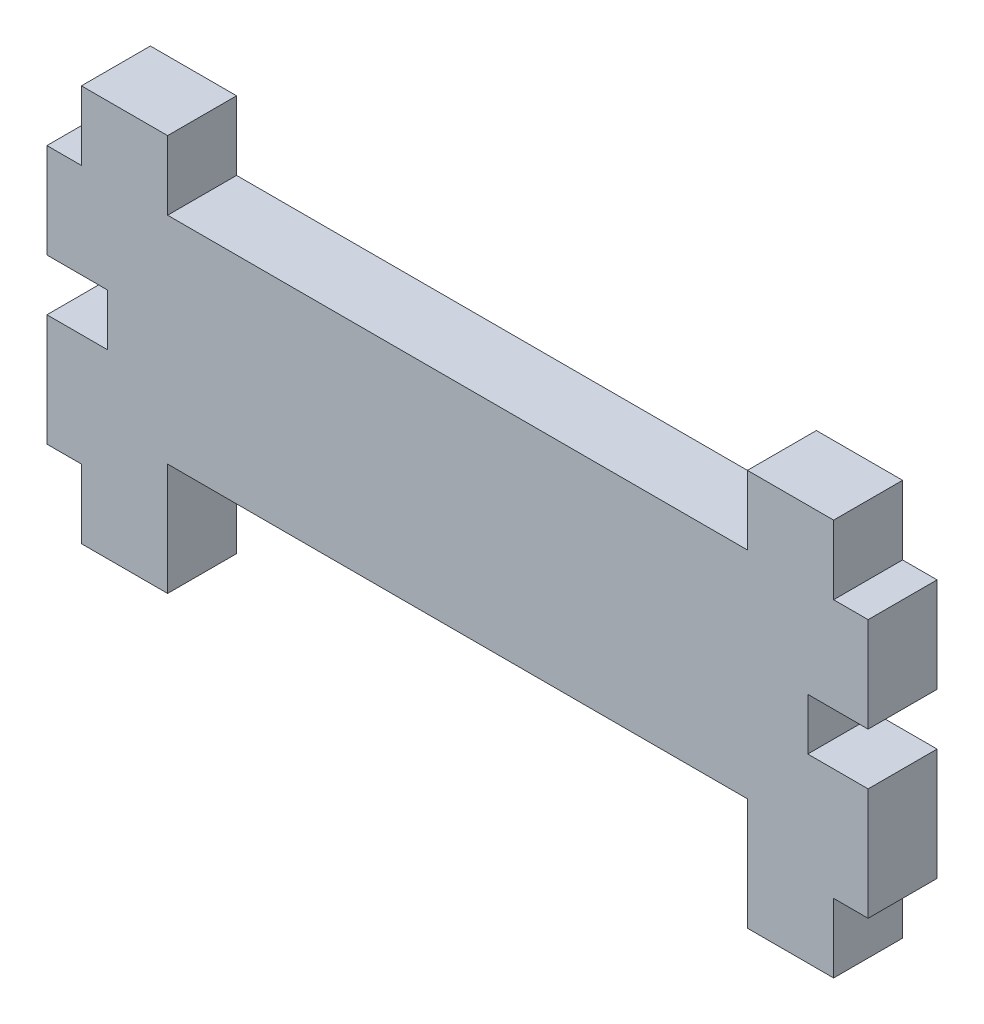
from build123d import *

# Parameters (mm, degrees)
SALIENTE_EXTRUIR1_DEPTH = 4


with BuildPart() as part:
    # Croquis1 → Saliente-Extruir1 (new body)
    with BuildSketch(Plane.XY):
        Polygon((-10.57873839, -2.314080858), (-12.57873839, -2.314080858), (-12.57873839, -7.814080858), (-9.07873839, -7.814080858), (-9.07873839, -10.814080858), (-12.57873839, -10.814080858), (-12.57873839, -17.314080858), (-10.57873839, -17.314080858), (-10.57873839, -21.314080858), (-5.57873839, -21.314080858), (-5.57873839, -17.314080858), (-5.57873839, -14.814080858), (28.05126161, -14.814080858), (28.05126161, -17.314080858), (28.05126161, -21.314080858), (33.05126161, -21.314080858), (33.05126161, -17.314080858), (35.05126161, -17.314080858), (35.05126161, -10.814080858), (31.55126161, -10.814080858), (31.55126161, -7.814080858), (35.05126161, -7.814080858), (35.05126161, -2.314080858), (33.05126161, -2.314080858), (33.05126161, 1.685919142), (28.05126161, 1.685919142), (28.05126161, -2.314080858), (-5.57873839, -2.314080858), (-5.57873839, 1.685919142), (-10.57873839, 1.685919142), align=None)
    extrude(amount=SALIENTE_EXTRUIR1_DEPTH)


solid = part.part
